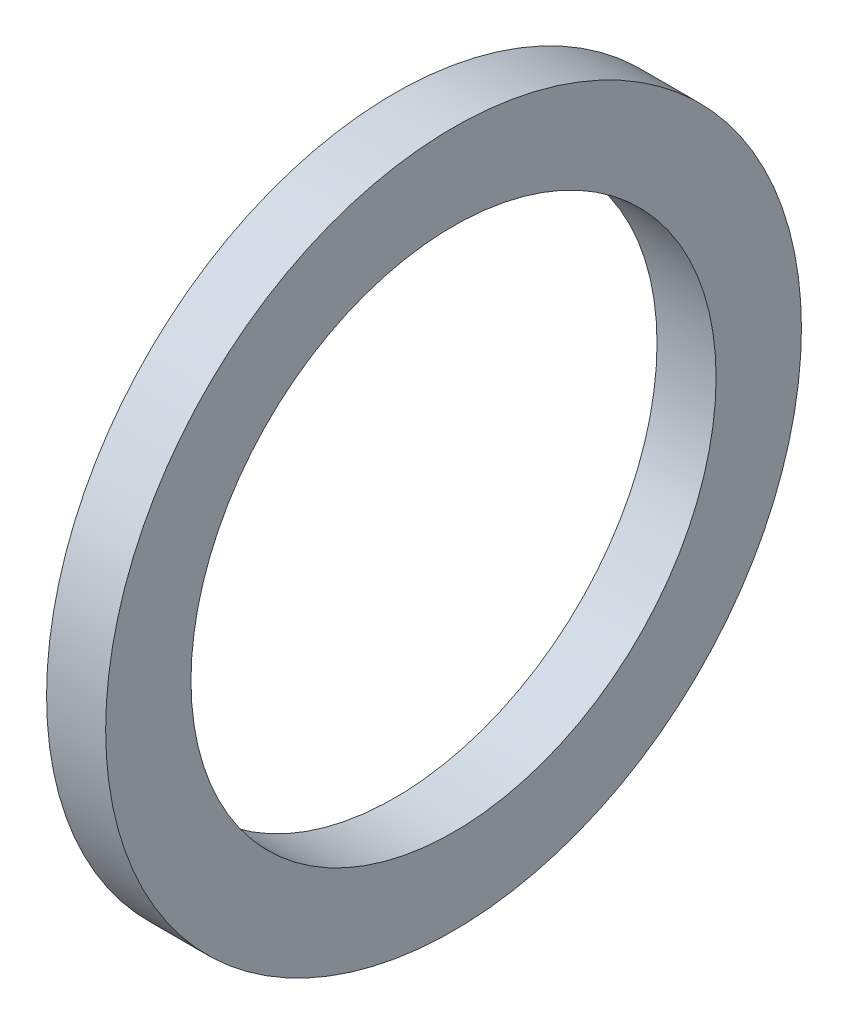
ISO-10303-21;
HEADER;
FILE_DESCRIPTION(('STEP AP214'),'2;1');
FILE_NAME('part.step','',(''),(''),'','','');
FILE_SCHEMA(('AUTOMOTIVE_DESIGN { 1 0 10303 214 1 1 1 1 }'));
ENDSEC;
DATA;
#1=APPLICATION_CONTEXT('core data for automotive mechanical design processes');
#2=APPLICATION_PROTOCOL_DEFINITION('international standard','automotive_design',2000,#1);
#3=PRODUCT_CONTEXT('',#1,'mechanical');
#4=PRODUCT('Part','Part','',(#3));
#5=PRODUCT_RELATED_PRODUCT_CATEGORY('part','',(#4));
#6=PRODUCT_DEFINITION_FORMATION('','',#4);
#7=PRODUCT_DEFINITION_CONTEXT('part definition',#1,'design');
#8=PRODUCT_DEFINITION('design','',#6,#7);
#9=PRODUCT_DEFINITION_SHAPE('','',#8);
#10=(LENGTH_UNIT() NAMED_UNIT(*) SI_UNIT(.MILLI.,.METRE.));
#11=(NAMED_UNIT(*) PLANE_ANGLE_UNIT() SI_UNIT($,.RADIAN.));
#12=(NAMED_UNIT(*) SI_UNIT($,.STERADIAN.) SOLID_ANGLE_UNIT());
#13=UNCERTAINTY_MEASURE_WITH_UNIT(LENGTH_MEASURE(1.E-05),#10,'distance_accuracy_value','');
#14=(GEOMETRIC_REPRESENTATION_CONTEXT(3) GLOBAL_UNCERTAINTY_ASSIGNED_CONTEXT((#13)) GLOBAL_UNIT_ASSIGNED_CONTEXT((#10,
#11,#12)) REPRESENTATION_CONTEXT('',''));
#15=CARTESIAN_POINT('',(0.,0.,0.));
#16=DIRECTION('',(0.,0.,1.));
#17=DIRECTION('',(1.,0.,0.));
#18=AXIS2_PLACEMENT_3D('',#15,#16,#17);
#19=CARTESIAN_POINT('',(0.45,0.,0.));
#20=DIRECTION('',(1.,0.,0.));
#21=DIRECTION('',(0.,0.,-1.));
#22=AXIS2_PLACEMENT_3D('',#19,#20,#21);
#23=PLANE('',#22);
#24=CARTESIAN_POINT('',(0.45,0.,0.));
#25=DIRECTION('',(1.,0.,0.));
#26=DIRECTION('',(0.,0.,-1.));
#27=AXIS2_PLACEMENT_3D('',#24,#25,#26);
#28=CIRCLE('',#27,5.3);
#29=CARTESIAN_POINT('',(0.45,0.,-5.3));
#30=VERTEX_POINT('',#29);
#31=EDGE_CURVE('E10',#30,#30,#28,.T.);
#32=ORIENTED_EDGE('',*,*,#31,.T.);
#33=EDGE_LOOP('',(#32));
#34=FACE_BOUND('',#33,.T.);
#35=CARTESIAN_POINT('',(0.45,0.,0.));
#36=DIRECTION('',(1.,0.,0.));
#37=DIRECTION('',(0.,0.,-1.));
#38=AXIS2_PLACEMENT_3D('',#35,#36,#37);
#39=CIRCLE('',#38,4.);
#40=CARTESIAN_POINT('',(0.45,0.,-4.));
#41=VERTEX_POINT('',#40);
#42=EDGE_CURVE('E39',#41,#41,#39,.T.);
#43=ORIENTED_EDGE('',*,*,#42,.F.);
#44=EDGE_LOOP('',(#43));
#45=FACE_BOUND('',#44,.T.);
#46=ADVANCED_FACE('F28',(#34,#45),#23,.T.);
#47=CARTESIAN_POINT('',(-0.45,0.,0.));
#48=DIRECTION('',(1.,0.,0.));
#49=DIRECTION('',(0.,0.,-1.));
#50=AXIS2_PLACEMENT_3D('',#47,#48,#49);
#51=PLANE('',#50);
#52=CARTESIAN_POINT('',(-0.45,0.,0.));
#53=DIRECTION('',(1.,0.,0.));
#54=DIRECTION('',(0.,0.,-1.));
#55=AXIS2_PLACEMENT_3D('',#52,#53,#54);
#56=CIRCLE('',#55,5.3);
#57=CARTESIAN_POINT('',(-0.45,0.,-5.3));
#58=VERTEX_POINT('',#57);
#59=EDGE_CURVE('E32',#58,#58,#56,.T.);
#60=ORIENTED_EDGE('',*,*,#59,.F.);
#61=EDGE_LOOP('',(#60));
#62=FACE_BOUND('',#61,.T.);
#63=CARTESIAN_POINT('',(-0.45,0.,0.));
#64=DIRECTION('',(1.,0.,0.));
#65=DIRECTION('',(0.,0.,-1.));
#66=AXIS2_PLACEMENT_3D('',#63,#64,#65);
#67=CIRCLE('',#66,4.);
#68=CARTESIAN_POINT('',(-0.45,0.,-4.));
#69=VERTEX_POINT('',#68);
#70=EDGE_CURVE('E41',#69,#69,#67,.T.);
#71=ORIENTED_EDGE('',*,*,#70,.T.);
#72=EDGE_LOOP('',(#71));
#73=FACE_BOUND('',#72,.T.);
#74=ADVANCED_FACE('F51',(#62,#73),#51,.F.);
#75=CARTESIAN_POINT('',(0.45,0.,0.));
#76=DIRECTION('',(-1.,0.,0.));
#77=DIRECTION('',(0.,0.,1.));
#78=AXIS2_PLACEMENT_3D('',#75,#76,#77);
#79=CYLINDRICAL_SURFACE('',#78,5.3);
#80=ORIENTED_EDGE('',*,*,#31,.F.);
#81=EDGE_LOOP('',(#80));
#82=FACE_BOUND('',#81,.T.);
#83=ORIENTED_EDGE('',*,*,#59,.T.);
#84=EDGE_LOOP('',(#83));
#85=FACE_BOUND('',#84,.T.);
#86=ADVANCED_FACE('F30',(#82,#85),#79,.T.);
#87=CARTESIAN_POINT('',(0.45,0.,0.));
#88=DIRECTION('',(-1.,0.,0.));
#89=DIRECTION('',(0.,0.,1.));
#90=AXIS2_PLACEMENT_3D('',#87,#88,#89);
#91=CYLINDRICAL_SURFACE('',#90,4.);
#92=ORIENTED_EDGE('',*,*,#42,.T.);
#93=EDGE_LOOP('',(#92));
#94=FACE_BOUND('',#93,.T.);
#95=ORIENTED_EDGE('',*,*,#70,.F.);
#96=EDGE_LOOP('',(#95));
#97=FACE_BOUND('',#96,.T.);
#98=ADVANCED_FACE('F47',(#94,#97),#91,.F.);
#99=CLOSED_SHELL('',(#46,#74,#86,#98));
#100=MANIFOLD_SOLID_BREP('B2',#99);
#101=ADVANCED_BREP_SHAPE_REPRESENTATION('',(#18,#100),#14);
#102=SHAPE_DEFINITION_REPRESENTATION(#9,#101);
ENDSEC;
END-ISO-10303-21;
